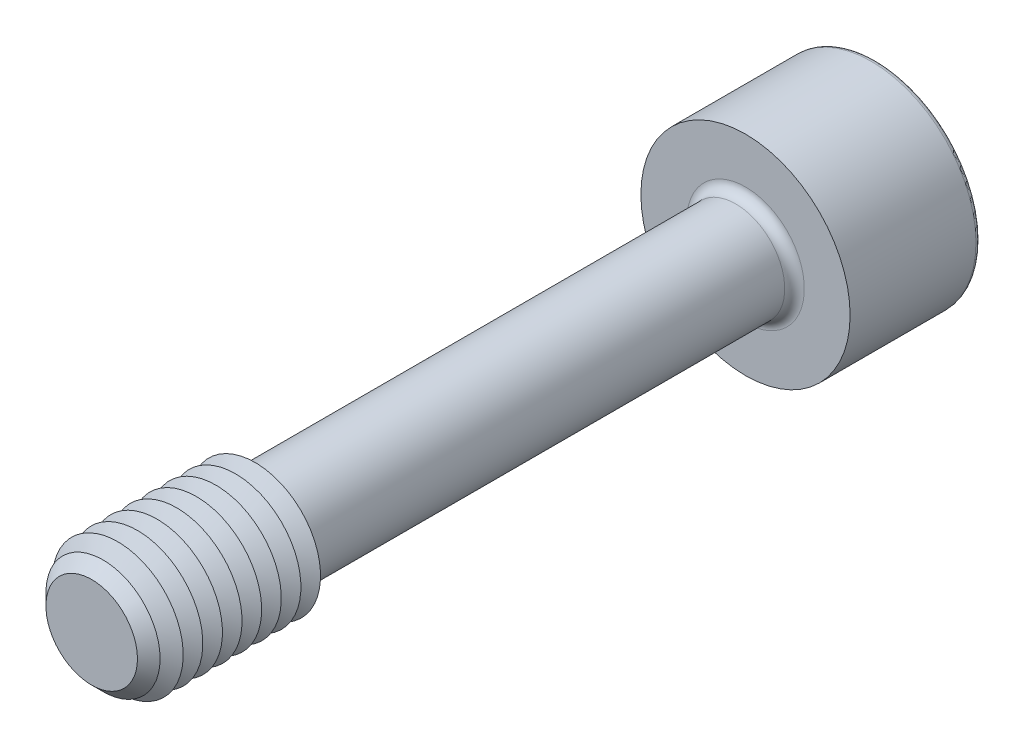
ISO-10303-21;
HEADER;
FILE_DESCRIPTION(('STEP AP214'),'2;1');
FILE_NAME('part.step','',(''),(''),'','','');
FILE_SCHEMA(('AUTOMOTIVE_DESIGN { 1 0 10303 214 1 1 1 1 }'));
ENDSEC;
DATA;
#1=APPLICATION_CONTEXT('core data for automotive mechanical design processes');
#2=APPLICATION_PROTOCOL_DEFINITION('international standard','automotive_design',2000,#1);
#3=PRODUCT_CONTEXT('',#1,'mechanical');
#4=PRODUCT('Part','Part','',(#3));
#5=PRODUCT_RELATED_PRODUCT_CATEGORY('part','',(#4));
#6=PRODUCT_DEFINITION_FORMATION('','',#4);
#7=PRODUCT_DEFINITION_CONTEXT('part definition',#1,'design');
#8=PRODUCT_DEFINITION('design','',#6,#7);
#9=PRODUCT_DEFINITION_SHAPE('','',#8);
#10=(LENGTH_UNIT() NAMED_UNIT(*) SI_UNIT(.MILLI.,.METRE.));
#11=(NAMED_UNIT(*) PLANE_ANGLE_UNIT() SI_UNIT($,.RADIAN.));
#12=(NAMED_UNIT(*) SI_UNIT($,.STERADIAN.) SOLID_ANGLE_UNIT());
#13=UNCERTAINTY_MEASURE_WITH_UNIT(LENGTH_MEASURE(1.E-05),#10,'distance_accuracy_value','');
#14=(GEOMETRIC_REPRESENTATION_CONTEXT(3) GLOBAL_UNCERTAINTY_ASSIGNED_CONTEXT((#13)) GLOBAL_UNIT_ASSIGNED_CONTEXT((#10,
#11,#12)) REPRESENTATION_CONTEXT('',''));
#15=CARTESIAN_POINT('',(0.,0.,0.));
#16=DIRECTION('',(0.,0.,1.));
#17=DIRECTION('',(1.,0.,0.));
#18=AXIS2_PLACEMENT_3D('',#15,#16,#17);
#19=CARTESIAN_POINT('',(-2.3094010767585,-4.,-27.));
#20=DIRECTION('',(0.,0.,1.));
#21=DIRECTION('',(1.,0.,0.));
#22=AXIS2_PLACEMENT_3D('',#19,#20,#21);
#23=PLANE('',#22);
#24=DIRECTION('',(1.,0.,0.));
#25=VECTOR('',#24,1.);
#26=CARTESIAN_POINT('',(-2.3094010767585,-4.,-27.));
#27=LINE('',#26,#25);
#28=CARTESIAN_POINT('',(0.,-4.,-27.));
#29=VERTEX_POINT('',#28);
#30=CARTESIAN_POINT('',(2.3094010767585,-4.,-27.));
#31=VERTEX_POINT('',#30);
#32=EDGE_CURVE('E762',#29,#31,#27,.T.);
#33=ORIENTED_EDGE('',*,*,#32,.F.);
#34=CARTESIAN_POINT('',(0.,0.,-27.));
#35=DIRECTION('',(0.,0.,1.));
#36=DIRECTION('',(0.,-1.,0.));
#37=AXIS2_PLACEMENT_3D('',#34,#35,#36);
#38=CIRCLE('',#37,4.);
#39=CARTESIAN_POINT('',(3.46410161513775,-2.,-27.));
#40=VERTEX_POINT('',#39);
#41=EDGE_CURVE('E53',#29,#40,#38,.T.);
#42=ORIENTED_EDGE('',*,*,#41,.T.);
#43=DIRECTION('',(0.5,0.866025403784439,0.));
#44=VECTOR('',#43,1.);
#45=CARTESIAN_POINT('',(2.3094010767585,-4.,-27.));
#46=LINE('',#45,#44);
#47=EDGE_CURVE('E748',#31,#40,#46,.T.);
#48=ORIENTED_EDGE('',*,*,#47,.F.);
#49=EDGE_LOOP('',(#33,#42,#48));
#50=FACE_BOUND('',#49,.T.);
#51=ADVANCED_FACE('F41',(#50),#23,.F.);
#52=CARTESIAN_POINT('',(4.618802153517,0.,-27.));
#53=VERTEX_POINT('',#52);
#54=EDGE_CURVE('E758',#40,#53,#46,.T.);
#55=ORIENTED_EDGE('',*,*,#54,.F.);
#56=CARTESIAN_POINT('',(3.46410161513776,2.,-27.));
#57=VERTEX_POINT('',#56);
#58=EDGE_CURVE('E11',#40,#57,#38,.T.);
#59=ORIENTED_EDGE('',*,*,#58,.T.);
#60=DIRECTION('',(-0.5,0.866025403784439,0.));
#61=VECTOR('',#60,1.);
#62=CARTESIAN_POINT('',(4.618802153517,0.,-27.));
#63=LINE('',#62,#61);
#64=EDGE_CURVE('E747',#53,#57,#63,.T.);
#65=ORIENTED_EDGE('',*,*,#64,.F.);
#66=EDGE_LOOP('',(#55,#59,#65));
#67=FACE_BOUND('',#66,.T.);
#68=ADVANCED_FACE('F133',(#67),#23,.F.);
#69=CARTESIAN_POINT('',(2.3094010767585,4.,-27.));
#70=VERTEX_POINT('',#69);
#71=EDGE_CURVE('E743',#57,#70,#63,.T.);
#72=ORIENTED_EDGE('',*,*,#71,.F.);
#73=CARTESIAN_POINT('',(0.,4.,-27.));
#74=VERTEX_POINT('',#73);
#75=EDGE_CURVE('E51',#57,#74,#38,.T.);
#76=ORIENTED_EDGE('',*,*,#75,.T.);
#77=DIRECTION('',(-1.,0.,0.));
#78=VECTOR('',#77,1.);
#79=CARTESIAN_POINT('',(2.3094010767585,4.,-27.));
#80=LINE('',#79,#78);
#81=EDGE_CURVE('E177',#70,#74,#80,.T.);
#82=ORIENTED_EDGE('',*,*,#81,.F.);
#83=EDGE_LOOP('',(#72,#76,#82));
#84=FACE_BOUND('',#83,.T.);
#85=ADVANCED_FACE('F139',(#84),#23,.F.);
#86=CARTESIAN_POINT('',(-2.3094010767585,4.,-27.));
#87=VERTEX_POINT('',#86);
#88=EDGE_CURVE('E753',#74,#87,#80,.T.);
#89=ORIENTED_EDGE('',*,*,#88,.F.);
#90=CARTESIAN_POINT('',(-3.46410161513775,2.,-27.));
#91=VERTEX_POINT('',#90);
#92=EDGE_CURVE('E262',#74,#91,#38,.T.);
#93=ORIENTED_EDGE('',*,*,#92,.T.);
#94=DIRECTION('',(-0.500000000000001,-0.866025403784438,0.));
#95=VECTOR('',#94,1.);
#96=CARTESIAN_POINT('',(-2.3094010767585,4.,-27.));
#97=LINE('',#96,#95);
#98=EDGE_CURVE('E176',#87,#91,#97,.T.);
#99=ORIENTED_EDGE('',*,*,#98,.F.);
#100=EDGE_LOOP('',(#89,#93,#99));
#101=FACE_BOUND('',#100,.T.);
#102=ADVANCED_FACE('F157',(#101),#23,.F.);
#103=CARTESIAN_POINT('',(-4.61880215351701,0.,-27.));
#104=VERTEX_POINT('',#103);
#105=EDGE_CURVE('E170',#91,#104,#97,.T.);
#106=ORIENTED_EDGE('',*,*,#105,.F.);
#107=CARTESIAN_POINT('',(-3.46410161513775,-2.,-27.));
#108=VERTEX_POINT('',#107);
#109=EDGE_CURVE('E172',#91,#108,#38,.T.);
#110=ORIENTED_EDGE('',*,*,#109,.T.);
#111=DIRECTION('',(0.5,-0.866025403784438,0.));
#112=VECTOR('',#111,1.);
#113=CARTESIAN_POINT('',(-4.61880215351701,0.,-27.));
#114=LINE('',#113,#112);
#115=EDGE_CURVE('E174',#104,#108,#114,.T.);
#116=ORIENTED_EDGE('',*,*,#115,.F.);
#117=EDGE_LOOP('',(#106,#110,#116));
#118=FACE_BOUND('',#117,.T.);
#119=ADVANCED_FACE('F146',(#118),#23,.F.);
#120=CARTESIAN_POINT('',(0.,0.,-35.));
#121=DIRECTION('',(0.,0.,-1.));
#122=DIRECTION('',(-1.,0.,0.));
#123=AXIS2_PLACEMENT_3D('',#120,#121,#122);
#124=PLANE('',#123);
#125=CARTESIAN_POINT('',(0.,0.,-35.));
#126=DIRECTION('',(0.,0.,-1.));
#127=DIRECTION('',(-1.,0.,0.));
#128=AXIS2_PLACEMENT_3D('',#125,#126,#127);
#129=CIRCLE('',#128,7.625);
#130=CARTESIAN_POINT('',(-7.625,0.,-35.));
#131=VERTEX_POINT('',#130);
#132=EDGE_CURVE('E250',#131,#131,#129,.T.);
#133=ORIENTED_EDGE('',*,*,#132,.T.);
#134=EDGE_LOOP('',(#133));
#135=FACE_BOUND('',#134,.T.);
#136=DIRECTION('',(-0.500000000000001,-0.866025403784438,0.));
#137=VECTOR('',#136,1.);
#138=CARTESIAN_POINT('',(-2.3094010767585,4.,-35.));
#139=LINE('',#138,#137);
#140=CARTESIAN_POINT('',(-2.3094010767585,4.,-35.));
#141=VERTEX_POINT('',#140);
#142=CARTESIAN_POINT('',(-4.61880215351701,0.,-35.));
#143=VERTEX_POINT('',#142);
#144=EDGE_CURVE('E212',#141,#143,#139,.T.);
#145=ORIENTED_EDGE('',*,*,#144,.T.);
#146=DIRECTION('',(0.5,-0.866025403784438,0.));
#147=VECTOR('',#146,1.);
#148=CARTESIAN_POINT('',(-4.61880215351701,0.,-35.));
#149=LINE('',#148,#147);
#150=CARTESIAN_POINT('',(-2.3094010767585,-4.,-35.));
#151=VERTEX_POINT('',#150);
#152=EDGE_CURVE('E67',#143,#151,#149,.T.);
#153=ORIENTED_EDGE('',*,*,#152,.T.);
#154=DIRECTION('',(1.,0.,0.));
#155=VECTOR('',#154,1.);
#156=CARTESIAN_POINT('',(-2.3094010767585,-4.,-35.));
#157=LINE('',#156,#155);
#158=CARTESIAN_POINT('',(2.3094010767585,-4.,-35.));
#159=VERTEX_POINT('',#158);
#160=EDGE_CURVE('E196',#151,#159,#157,.T.);
#161=ORIENTED_EDGE('',*,*,#160,.T.);
#162=DIRECTION('',(0.5,0.866025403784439,0.));
#163=VECTOR('',#162,1.);
#164=CARTESIAN_POINT('',(2.3094010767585,-4.,-35.));
#165=LINE('',#164,#163);
#166=CARTESIAN_POINT('',(4.618802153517,0.,-35.));
#167=VERTEX_POINT('',#166);
#168=EDGE_CURVE('E200',#159,#167,#165,.T.);
#169=ORIENTED_EDGE('',*,*,#168,.T.);
#170=DIRECTION('',(-0.5,0.866025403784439,0.));
#171=VECTOR('',#170,1.);
#172=CARTESIAN_POINT('',(4.618802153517,0.,-35.));
#173=LINE('',#172,#171);
#174=CARTESIAN_POINT('',(2.3094010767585,4.,-35.));
#175=VERTEX_POINT('',#174);
#176=EDGE_CURVE('E204',#167,#175,#173,.T.);
#177=ORIENTED_EDGE('',*,*,#176,.T.);
#178=DIRECTION('',(-1.,0.,0.));
#179=VECTOR('',#178,1.);
#180=CARTESIAN_POINT('',(2.3094010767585,4.,-35.));
#181=LINE('',#180,#179);
#182=EDGE_CURVE('E208',#175,#141,#181,.T.);
#183=ORIENTED_EDGE('',*,*,#182,.T.);
#184=EDGE_LOOP('',(#145,#153,#161,#169,#177,#183));
#185=FACE_BOUND('',#184,.T.);
#186=ADVANCED_FACE('F156',(#135,#185),#124,.T.);
#187=CARTESIAN_POINT('',(0.,0.,25.));
#188=DIRECTION('',(0.,0.,-1.));
#189=DIRECTION('',(-1.,0.,0.));
#190=AXIS2_PLACEMENT_3D('',#187,#188,#189);
#191=CYLINDRICAL_SURFACE('',#190,3.75);
#192=CARTESIAN_POINT('',(0.,0.,-24.25));
#193=DIRECTION('',(0.,0.,-1.));
#194=DIRECTION('',(-1.,0.,0.));
#195=AXIS2_PLACEMENT_3D('',#192,#193,#194);
#196=CIRCLE('',#195,3.75);
#197=CARTESIAN_POINT('',(-3.75,0.,-24.25));
#198=VERTEX_POINT('',#197);
#199=EDGE_CURVE('E247',#198,#198,#196,.F.);
#200=ORIENTED_EDGE('',*,*,#199,.T.);
#201=EDGE_LOOP('',(#200));
#202=FACE_BOUND('',#201,.T.);
#203=CARTESIAN_POINT('',(0.,0.,11.778312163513));
#204=DIRECTION('',(0.,0.,-1.));
#205=DIRECTION('',(0.,1.,0.));
#206=AXIS2_PLACEMENT_3D('',#203,#204,#205);
#207=CIRCLE('',#206,3.75);
#208=CARTESIAN_POINT('',(0.,3.75,11.778312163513));
#209=VERTEX_POINT('',#208);
#210=EDGE_CURVE('E235',#209,#209,#207,.T.);
#211=ORIENTED_EDGE('',*,*,#210,.T.);
#212=EDGE_LOOP('',(#211));
#213=FACE_BOUND('',#212,.T.);
#214=ADVANCED_FACE('F163',(#202,#213),#191,.T.);
#215=CARTESIAN_POINT('',(0.,0.,11.778312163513));
#216=DIRECTION('',(0.,0.,1.));
#217=DIRECTION('',(0.,-1.,0.));
#218=AXIS2_PLACEMENT_3D('',#215,#216,#217);
#219=CONICAL_SURFACE('',#218,3.75,1.0471975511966);
#220=CARTESIAN_POINT('',(0.,0.,12.5));
#221=DIRECTION('',(0.,0.,-1.));
#222=DIRECTION('',(-1.,0.,0.));
#223=AXIS2_PLACEMENT_3D('',#220,#221,#222);
#224=CIRCLE('',#223,5.);
#225=CARTESIAN_POINT('',(-5.,0.,12.5));
#226=VERTEX_POINT('',#225);
#227=EDGE_CURVE('E266',#226,#226,#224,.T.);
#228=ORIENTED_EDGE('',*,*,#227,.T.);
#229=EDGE_LOOP('',(#228));
#230=FACE_BOUND('',#229,.T.);
#231=ORIENTED_EDGE('',*,*,#210,.F.);
#232=EDGE_LOOP('',(#231));
#233=FACE_BOUND('',#232,.T.);
#234=ADVANCED_FACE('F512',(#230,#233),#219,.T.);
#235=CARTESIAN_POINT('',(0.,0.,-25.));
#236=DIRECTION('',(0.,0.,-1.));
#237=DIRECTION('',(-1.,0.,0.));
#238=AXIS2_PLACEMENT_3D('',#235,#236,#237);
#239=PLANE('',#238);
#240=CARTESIAN_POINT('',(0.,0.,-25.));
#241=DIRECTION('',(0.,0.,-1.));
#242=DIRECTION('',(-1.,0.,0.));
#243=AXIS2_PLACEMENT_3D('',#240,#241,#242);
#244=CIRCLE('',#243,4.5);
#245=CARTESIAN_POINT('',(-4.5,0.,-25.));
#246=VERTEX_POINT('',#245);
#247=EDGE_CURVE('E243',#246,#246,#244,.T.);
#248=ORIENTED_EDGE('',*,*,#247,.T.);
#249=EDGE_LOOP('',(#248));
#250=FACE_BOUND('',#249,.T.);
#251=CARTESIAN_POINT('',(0.,0.,-25.));
#252=DIRECTION('',(0.,0.,-1.));
#253=DIRECTION('',(-1.,0.,0.));
#254=AXIS2_PLACEMENT_3D('',#251,#252,#253);
#255=CIRCLE('',#254,8.);
#256=CARTESIAN_POINT('',(-8.,0.,-25.));
#257=VERTEX_POINT('',#256);
#258=EDGE_CURVE('E231',#257,#257,#255,.T.);
#259=ORIENTED_EDGE('',*,*,#258,.F.);
#260=EDGE_LOOP('',(#259));
#261=FACE_BOUND('',#260,.T.);
#262=ADVANCED_FACE('F505',(#250,#261),#239,.F.);
#263=CARTESIAN_POINT('',(0.,0.,-35.));
#264=DIRECTION('',(0.,0.,1.));
#265=DIRECTION('',(1.,0.,0.));
#266=AXIS2_PLACEMENT_3D('',#263,#264,#265);
#267=CYLINDRICAL_SURFACE('',#266,8.);
#268=CARTESIAN_POINT('',(0.,0.,-34.625));
#269=DIRECTION('',(0.,0.,-1.));
#270=DIRECTION('',(-1.,0.,0.));
#271=AXIS2_PLACEMENT_3D('',#268,#269,#270);
#272=CIRCLE('',#271,8.);
#273=CARTESIAN_POINT('',(-8.,0.,-34.625));
#274=VERTEX_POINT('',#273);
#275=EDGE_CURVE('E253',#274,#274,#272,.F.);
#276=ORIENTED_EDGE('',*,*,#275,.T.);
#277=EDGE_LOOP('',(#276));
#278=FACE_BOUND('',#277,.T.);
#279=ORIENTED_EDGE('',*,*,#258,.T.);
#280=EDGE_LOOP('',(#279));
#281=FACE_BOUND('',#280,.T.);
#282=ADVANCED_FACE('F511',(#278,#281),#267,.T.);
#283=CARTESIAN_POINT('',(-4.61880215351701,0.,-27.));
#284=DIRECTION('',(0.866025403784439,0.5,0.));
#285=DIRECTION('',(-0.5,0.866025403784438,0.));
#286=AXIS2_PLACEMENT_3D('',#283,#284,#285);
#287=PLANE('',#286);
#288=ORIENTED_EDGE('',*,*,#152,.F.);
#289=DIRECTION('',(0.,0.,-1.));
#290=VECTOR('',#289,1.);
#291=CARTESIAN_POINT('',(-4.61880215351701,0.,-27.));
#292=LINE('',#291,#290);
#293=EDGE_CURVE('E186',#104,#143,#292,.T.);
#294=ORIENTED_EDGE('',*,*,#293,.F.);
#295=ORIENTED_EDGE('',*,*,#115,.T.);
#296=CARTESIAN_POINT('',(-2.3094010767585,-4.,-27.));
#297=VERTEX_POINT('',#296);
#298=EDGE_CURVE('E215',#108,#297,#114,.T.);
#299=ORIENTED_EDGE('',*,*,#298,.T.);
#300=DIRECTION('',(0.,0.,-1.));
#301=VECTOR('',#300,1.);
#302=CARTESIAN_POINT('',(-2.3094010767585,-4.,-27.));
#303=LINE('',#302,#301);
#304=EDGE_CURVE('E228',#297,#151,#303,.T.);
#305=ORIENTED_EDGE('',*,*,#304,.T.);
#306=EDGE_LOOP('',(#288,#294,#295,#299,#305));
#307=FACE_BOUND('',#306,.T.);
#308=ADVANCED_FACE('F523',(#307),#287,.T.);
#309=CARTESIAN_POINT('',(-2.3094010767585,-4.,-27.));
#310=DIRECTION('',(0.,1.,0.));
#311=DIRECTION('',(-1.,0.,0.));
#312=AXIS2_PLACEMENT_3D('',#309,#310,#311);
#313=PLANE('',#312);
#314=ORIENTED_EDGE('',*,*,#160,.F.);
#315=ORIENTED_EDGE('',*,*,#304,.F.);
#316=EDGE_CURVE('E759',#297,#29,#27,.T.);
#317=ORIENTED_EDGE('',*,*,#316,.T.);
#318=ORIENTED_EDGE('',*,*,#32,.T.);
#319=DIRECTION('',(0.,0.,-1.));
#320=VECTOR('',#319,1.);
#321=CARTESIAN_POINT('',(2.3094010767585,-4.,-27.));
#322=LINE('',#321,#320);
#323=EDGE_CURVE('E225',#31,#159,#322,.T.);
#324=ORIENTED_EDGE('',*,*,#323,.T.);
#325=EDGE_LOOP('',(#314,#315,#317,#318,#324));
#326=FACE_BOUND('',#325,.T.);
#327=ADVANCED_FACE('F539',(#326),#313,.T.);
#328=CARTESIAN_POINT('',(2.3094010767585,-4.,-27.));
#329=DIRECTION('',(-0.866025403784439,0.5,0.));
#330=DIRECTION('',(-0.5,-0.866025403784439,0.));
#331=AXIS2_PLACEMENT_3D('',#328,#329,#330);
#332=PLANE('',#331);
#333=ORIENTED_EDGE('',*,*,#168,.F.);
#334=ORIENTED_EDGE('',*,*,#323,.F.);
#335=ORIENTED_EDGE('',*,*,#47,.T.);
#336=ORIENTED_EDGE('',*,*,#54,.T.);
#337=DIRECTION('',(0.,0.,-1.));
#338=VECTOR('',#337,1.);
#339=CARTESIAN_POINT('',(4.618802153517,0.,-27.));
#340=LINE('',#339,#338);
#341=EDGE_CURVE('E222',#53,#167,#340,.T.);
#342=ORIENTED_EDGE('',*,*,#341,.T.);
#343=EDGE_LOOP('',(#333,#334,#335,#336,#342));
#344=FACE_BOUND('',#343,.T.);
#345=ADVANCED_FACE('F549',(#344),#332,.T.);
#346=CARTESIAN_POINT('',(4.618802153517,0.,-27.));
#347=DIRECTION('',(-0.866025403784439,-0.5,0.));
#348=DIRECTION('',(0.5,-0.866025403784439,0.));
#349=AXIS2_PLACEMENT_3D('',#346,#347,#348);
#350=PLANE('',#349);
#351=ORIENTED_EDGE('',*,*,#176,.F.);
#352=ORIENTED_EDGE('',*,*,#341,.F.);
#353=ORIENTED_EDGE('',*,*,#64,.T.);
#354=ORIENTED_EDGE('',*,*,#71,.T.);
#355=DIRECTION('',(0.,0.,-1.));
#356=VECTOR('',#355,1.);
#357=CARTESIAN_POINT('',(2.3094010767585,4.,-27.));
#358=LINE('',#357,#356);
#359=EDGE_CURVE('E219',#70,#175,#358,.T.);
#360=ORIENTED_EDGE('',*,*,#359,.T.);
#361=EDGE_LOOP('',(#351,#352,#353,#354,#360));
#362=FACE_BOUND('',#361,.T.);
#363=ADVANCED_FACE('F559',(#362),#350,.T.);
#364=CARTESIAN_POINT('',(2.3094010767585,4.,-27.));
#365=DIRECTION('',(0.,-1.,0.));
#366=DIRECTION('',(0.,0.,-1.));
#367=AXIS2_PLACEMENT_3D('',#364,#365,#366);
#368=PLANE('',#367);
#369=ORIENTED_EDGE('',*,*,#182,.F.);
#370=ORIENTED_EDGE('',*,*,#359,.F.);
#371=ORIENTED_EDGE('',*,*,#81,.T.);
#372=ORIENTED_EDGE('',*,*,#88,.T.);
#373=DIRECTION('',(0.,0.,-1.));
#374=VECTOR('',#373,1.);
#375=CARTESIAN_POINT('',(-2.3094010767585,4.,-27.));
#376=LINE('',#375,#374);
#377=EDGE_CURVE('E182',#87,#141,#376,.T.);
#378=ORIENTED_EDGE('',*,*,#377,.T.);
#379=EDGE_LOOP('',(#369,#370,#371,#372,#378));
#380=FACE_BOUND('',#379,.T.);
#381=ADVANCED_FACE('F152',(#380),#368,.T.);
#382=CARTESIAN_POINT('',(-2.3094010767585,4.,-27.));
#383=DIRECTION('',(0.866025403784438,-0.500000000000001,0.));
#384=DIRECTION('',(0.500000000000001,0.866025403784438,0.));
#385=AXIS2_PLACEMENT_3D('',#382,#383,#384);
#386=PLANE('',#385);
#387=ORIENTED_EDGE('',*,*,#144,.F.);
#388=ORIENTED_EDGE('',*,*,#377,.F.);
#389=ORIENTED_EDGE('',*,*,#98,.T.);
#390=ORIENTED_EDGE('',*,*,#105,.T.);
#391=ORIENTED_EDGE('',*,*,#293,.T.);
#392=EDGE_LOOP('',(#387,#388,#389,#390,#391));
#393=FACE_BOUND('',#392,.T.);
#394=ADVANCED_FACE('F144',(#393),#386,.T.);
#395=ORIENTED_EDGE('',*,*,#298,.F.);
#396=EDGE_CURVE('E256',#108,#29,#38,.T.);
#397=ORIENTED_EDGE('',*,*,#396,.T.);
#398=ORIENTED_EDGE('',*,*,#316,.F.);
#399=EDGE_LOOP('',(#395,#397,#398));
#400=FACE_BOUND('',#399,.T.);
#401=ADVANCED_FACE('F135',(#400),#23,.F.);
#402=CARTESIAN_POINT('',(0.,0.,-24.25));
#403=DIRECTION('',(0.,0.,-1.));
#404=DIRECTION('',(-1.,0.,0.));
#405=AXIS2_PLACEMENT_3D('',#402,#403,#404);
#406=TOROIDAL_SURFACE('',#405,4.5,0.75);
#407=ORIENTED_EDGE('',*,*,#199,.F.);
#408=EDGE_LOOP('',(#407));
#409=FACE_BOUND('',#408,.T.);
#410=ORIENTED_EDGE('',*,*,#247,.F.);
#411=EDGE_LOOP('',(#410));
#412=FACE_BOUND('',#411,.T.);
#413=ADVANCED_FACE('F129',(#409,#412),#406,.F.);
#414=CARTESIAN_POINT('',(0.,0.,-34.625));
#415=DIRECTION('',(0.,0.,-1.));
#416=DIRECTION('',(-1.,0.,0.));
#417=AXIS2_PLACEMENT_3D('',#414,#415,#416);
#418=TOROIDAL_SURFACE('',#417,7.625,0.375);
#419=ORIENTED_EDGE('',*,*,#275,.F.);
#420=EDGE_LOOP('',(#419));
#421=FACE_BOUND('',#420,.T.);
#422=ORIENTED_EDGE('',*,*,#132,.F.);
#423=EDGE_LOOP('',(#422));
#424=FACE_BOUND('',#423,.T.);
#425=ADVANCED_FACE('F43',(#421,#424),#418,.T.);
#426=CARTESIAN_POINT('',(0.,0.,-24.6905989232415));
#427=DIRECTION('',(0.,0.,-1.));
#428=DIRECTION('',(0.,1.,0.));
#429=AXIS2_PLACEMENT_3D('',#426,#427,#428);
#430=CONICAL_SURFACE('',#429,0.,1.0471975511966);
#431=ORIENTED_EDGE('',*,*,#41,.F.);
#432=ORIENTED_EDGE('',*,*,#396,.F.);
#433=ORIENTED_EDGE('',*,*,#109,.F.);
#434=ORIENTED_EDGE('',*,*,#92,.F.);
#435=ORIENTED_EDGE('',*,*,#75,.F.);
#436=ORIENTED_EDGE('',*,*,#58,.F.);
#437=EDGE_LOOP('',(#431,#432,#433,#434,#435,#436));
#438=FACE_BOUND('',#437,.T.);
#439=CARTESIAN_POINT('',(0.,0.,-24.6905989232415));
#440=VERTEX_POINT('',#439);
#441=VERTEX_LOOP('',#440);
#442=FACE_BOUND('',#441,.T.);
#443=ADVANCED_FACE('F118',(#438,#442),#430,.F.);
#444=CARTESIAN_POINT('',(0.,0.,13.25));
#445=DIRECTION('',(0.,0.,-1.));
#446=DIRECTION('',(-1.,0.,0.));
#447=AXIS2_PLACEMENT_3D('',#444,#445,#446);
#448=CONICAL_SURFACE('',#447,3.70096189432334,1.0471975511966);
#449=ORIENTED_EDGE('',*,*,#227,.F.);
#450=EDGE_LOOP('',(#449));
#451=FACE_BOUND('',#450,.T.);
#452=CARTESIAN_POINT('',(0.,0.,13.25));
#453=DIRECTION('',(0.,0.,-1.));
#454=DIRECTION('',(-1.,0.,0.));
#455=AXIS2_PLACEMENT_3D('',#452,#453,#454);
#456=CIRCLE('',#455,3.70096189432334);
#457=CARTESIAN_POINT('',(-3.70096189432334,0.,13.25));
#458=VERTEX_POINT('',#457);
#459=EDGE_CURVE('E272',#458,#458,#456,.T.);
#460=ORIENTED_EDGE('',*,*,#459,.T.);
#461=EDGE_LOOP('',(#460));
#462=FACE_BOUND('',#461,.T.);
#463=ADVANCED_FACE('F120',(#451,#462),#448,.T.);
#464=CARTESIAN_POINT('',(0.,0.,14.));
#465=DIRECTION('',(0.,0.,1.));
#466=DIRECTION('',(1.,0.,0.));
#467=AXIS2_PLACEMENT_3D('',#464,#465,#466);
#468=CONICAL_SURFACE('',#467,5.,1.0471975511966);
#469=ORIENTED_EDGE('',*,*,#459,.F.);
#470=EDGE_LOOP('',(#469));
#471=FACE_BOUND('',#470,.T.);
#472=CARTESIAN_POINT('',(0.,0.,14.));
#473=DIRECTION('',(0.,0.,-1.));
#474=DIRECTION('',(-1.,0.,0.));
#475=AXIS2_PLACEMENT_3D('',#472,#473,#474);
#476=CIRCLE('',#475,5.);
#477=CARTESIAN_POINT('',(-5.,0.,14.));
#478=VERTEX_POINT('',#477);
#479=EDGE_CURVE('E279',#478,#478,#476,.T.);
#480=ORIENTED_EDGE('',*,*,#479,.T.);
#481=EDGE_LOOP('',(#480));
#482=FACE_BOUND('',#481,.T.);
#483=ADVANCED_FACE('F126',(#471,#482),#468,.T.);
#484=CARTESIAN_POINT('',(0.,0.,14.75));
#485=DIRECTION('',(0.,0.,-1.));
#486=DIRECTION('',(-1.,0.,0.));
#487=AXIS2_PLACEMENT_3D('',#484,#485,#486);
#488=CONICAL_SURFACE('',#487,3.70096189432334,1.0471975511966);
#489=ORIENTED_EDGE('',*,*,#479,.F.);
#490=EDGE_LOOP('',(#489));
#491=FACE_BOUND('',#490,.T.);
#492=CARTESIAN_POINT('',(0.,0.,14.75));
#493=DIRECTION('',(0.,0.,-1.));
#494=DIRECTION('',(-1.,0.,0.));
#495=AXIS2_PLACEMENT_3D('',#492,#493,#494);
#496=CIRCLE('',#495,3.70096189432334);
#497=CARTESIAN_POINT('',(-3.70096189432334,0.,14.75));
#498=VERTEX_POINT('',#497);
#499=EDGE_CURVE('E285',#498,#498,#496,.T.);
#500=ORIENTED_EDGE('',*,*,#499,.T.);
#501=EDGE_LOOP('',(#500));
#502=FACE_BOUND('',#501,.T.);
#503=ADVANCED_FACE('F399',(#491,#502),#488,.T.);
#504=CARTESIAN_POINT('',(0.,0.,15.5));
#505=DIRECTION('',(0.,0.,1.));
#506=DIRECTION('',(1.,0.,0.));
#507=AXIS2_PLACEMENT_3D('',#504,#505,#506);
#508=CONICAL_SURFACE('',#507,5.,1.0471975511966);
#509=ORIENTED_EDGE('',*,*,#499,.F.);
#510=EDGE_LOOP('',(#509));
#511=FACE_BOUND('',#510,.T.);
#512=CARTESIAN_POINT('',(0.,0.,15.5));
#513=DIRECTION('',(0.,0.,-1.));
#514=DIRECTION('',(-1.,0.,0.));
#515=AXIS2_PLACEMENT_3D('',#512,#513,#514);
#516=CIRCLE('',#515,5.);
#517=CARTESIAN_POINT('',(-5.,0.,15.5));
#518=VERTEX_POINT('',#517);
#519=EDGE_CURVE('E289',#518,#518,#516,.T.);
#520=ORIENTED_EDGE('',*,*,#519,.T.);
#521=EDGE_LOOP('',(#520));
#522=FACE_BOUND('',#521,.T.);
#523=ADVANCED_FACE('F395',(#511,#522),#508,.T.);
#524=CARTESIAN_POINT('',(0.,0.,16.25));
#525=DIRECTION('',(0.,0.,-1.));
#526=DIRECTION('',(-1.,0.,0.));
#527=AXIS2_PLACEMENT_3D('',#524,#525,#526);
#528=CONICAL_SURFACE('',#527,3.70096189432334,1.0471975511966);
#529=ORIENTED_EDGE('',*,*,#519,.F.);
#530=EDGE_LOOP('',(#529));
#531=FACE_BOUND('',#530,.T.);
#532=CARTESIAN_POINT('',(0.,0.,16.25));
#533=DIRECTION('',(0.,0.,-1.));
#534=DIRECTION('',(-1.,0.,0.));
#535=AXIS2_PLACEMENT_3D('',#532,#533,#534);
#536=CIRCLE('',#535,3.70096189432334);
#537=CARTESIAN_POINT('',(-3.70096189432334,0.,16.25));
#538=VERTEX_POINT('',#537);
#539=EDGE_CURVE('E293',#538,#538,#536,.T.);
#540=ORIENTED_EDGE('',*,*,#539,.T.);
#541=EDGE_LOOP('',(#540));
#542=FACE_BOUND('',#541,.T.);
#543=ADVANCED_FACE('F391',(#531,#542),#528,.T.);
#544=CARTESIAN_POINT('',(0.,0.,17.));
#545=DIRECTION('',(0.,0.,1.));
#546=DIRECTION('',(1.,0.,0.));
#547=AXIS2_PLACEMENT_3D('',#544,#545,#546);
#548=CONICAL_SURFACE('',#547,5.,1.0471975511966);
#549=ORIENTED_EDGE('',*,*,#539,.F.);
#550=EDGE_LOOP('',(#549));
#551=FACE_BOUND('',#550,.T.);
#552=CARTESIAN_POINT('',(0.,0.,17.));
#553=DIRECTION('',(0.,0.,-1.));
#554=DIRECTION('',(-1.,0.,0.));
#555=AXIS2_PLACEMENT_3D('',#552,#553,#554);
#556=CIRCLE('',#555,5.);
#557=CARTESIAN_POINT('',(-5.,0.,17.));
#558=VERTEX_POINT('',#557);
#559=EDGE_CURVE('E297',#558,#558,#556,.T.);
#560=ORIENTED_EDGE('',*,*,#559,.T.);
#561=EDGE_LOOP('',(#560));
#562=FACE_BOUND('',#561,.T.);
#563=ADVANCED_FACE('F387',(#551,#562),#548,.T.);
#564=CARTESIAN_POINT('',(0.,0.,17.75));
#565=DIRECTION('',(0.,0.,-1.));
#566=DIRECTION('',(-1.,0.,0.));
#567=AXIS2_PLACEMENT_3D('',#564,#565,#566);
#568=CONICAL_SURFACE('',#567,3.70096189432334,1.0471975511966);
#569=ORIENTED_EDGE('',*,*,#559,.F.);
#570=EDGE_LOOP('',(#569));
#571=FACE_BOUND('',#570,.T.);
#572=CARTESIAN_POINT('',(0.,0.,17.75));
#573=DIRECTION('',(0.,0.,-1.));
#574=DIRECTION('',(-1.,0.,0.));
#575=AXIS2_PLACEMENT_3D('',#572,#573,#574);
#576=CIRCLE('',#575,3.70096189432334);
#577=CARTESIAN_POINT('',(-3.70096189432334,0.,17.75));
#578=VERTEX_POINT('',#577);
#579=EDGE_CURVE('E301',#578,#578,#576,.T.);
#580=ORIENTED_EDGE('',*,*,#579,.T.);
#581=EDGE_LOOP('',(#580));
#582=FACE_BOUND('',#581,.T.);
#583=ADVANCED_FACE('F383',(#571,#582),#568,.T.);
#584=CARTESIAN_POINT('',(0.,0.,18.5));
#585=DIRECTION('',(0.,0.,1.));
#586=DIRECTION('',(1.,0.,0.));
#587=AXIS2_PLACEMENT_3D('',#584,#585,#586);
#588=CONICAL_SURFACE('',#587,5.,1.0471975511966);
#589=ORIENTED_EDGE('',*,*,#579,.F.);
#590=EDGE_LOOP('',(#589));
#591=FACE_BOUND('',#590,.T.);
#592=CARTESIAN_POINT('',(0.,0.,18.5));
#593=DIRECTION('',(0.,0.,-1.));
#594=DIRECTION('',(-1.,0.,0.));
#595=AXIS2_PLACEMENT_3D('',#592,#593,#594);
#596=CIRCLE('',#595,5.);
#597=CARTESIAN_POINT('',(-5.,0.,18.5));
#598=VERTEX_POINT('',#597);
#599=EDGE_CURVE('E305',#598,#598,#596,.T.);
#600=ORIENTED_EDGE('',*,*,#599,.T.);
#601=EDGE_LOOP('',(#600));
#602=FACE_BOUND('',#601,.T.);
#603=ADVANCED_FACE('F379',(#591,#602),#588,.T.);
#604=CARTESIAN_POINT('',(0.,0.,19.25));
#605=DIRECTION('',(0.,0.,-1.));
#606=DIRECTION('',(-1.,0.,0.));
#607=AXIS2_PLACEMENT_3D('',#604,#605,#606);
#608=CONICAL_SURFACE('',#607,3.70096189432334,1.0471975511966);
#609=ORIENTED_EDGE('',*,*,#599,.F.);
#610=EDGE_LOOP('',(#609));
#611=FACE_BOUND('',#610,.T.);
#612=CARTESIAN_POINT('',(0.,0.,19.25));
#613=DIRECTION('',(0.,0.,-1.));
#614=DIRECTION('',(-1.,0.,0.));
#615=AXIS2_PLACEMENT_3D('',#612,#613,#614);
#616=CIRCLE('',#615,3.70096189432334);
#617=CARTESIAN_POINT('',(-3.70096189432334,0.,19.25));
#618=VERTEX_POINT('',#617);
#619=EDGE_CURVE('E309',#618,#618,#616,.T.);
#620=ORIENTED_EDGE('',*,*,#619,.T.);
#621=EDGE_LOOP('',(#620));
#622=FACE_BOUND('',#621,.T.);
#623=ADVANCED_FACE('F375',(#611,#622),#608,.T.);
#624=CARTESIAN_POINT('',(0.,0.,20.));
#625=DIRECTION('',(0.,0.,1.));
#626=DIRECTION('',(1.,0.,0.));
#627=AXIS2_PLACEMENT_3D('',#624,#625,#626);
#628=CONICAL_SURFACE('',#627,5.,1.0471975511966);
#629=ORIENTED_EDGE('',*,*,#619,.F.);
#630=EDGE_LOOP('',(#629));
#631=FACE_BOUND('',#630,.T.);
#632=CARTESIAN_POINT('',(0.,0.,20.));
#633=DIRECTION('',(0.,0.,-1.));
#634=DIRECTION('',(-1.,0.,0.));
#635=AXIS2_PLACEMENT_3D('',#632,#633,#634);
#636=CIRCLE('',#635,5.);
#637=CARTESIAN_POINT('',(-5.,0.,20.));
#638=VERTEX_POINT('',#637);
#639=EDGE_CURVE('E313',#638,#638,#636,.T.);
#640=ORIENTED_EDGE('',*,*,#639,.T.);
#641=EDGE_LOOP('',(#640));
#642=FACE_BOUND('',#641,.T.);
#643=ADVANCED_FACE('F371',(#631,#642),#628,.T.);
#644=CARTESIAN_POINT('',(0.,0.,20.75));
#645=DIRECTION('',(0.,0.,-1.));
#646=DIRECTION('',(-1.,0.,0.));
#647=AXIS2_PLACEMENT_3D('',#644,#645,#646);
#648=CONICAL_SURFACE('',#647,3.70096189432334,1.0471975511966);
#649=ORIENTED_EDGE('',*,*,#639,.F.);
#650=EDGE_LOOP('',(#649));
#651=FACE_BOUND('',#650,.T.);
#652=CARTESIAN_POINT('',(0.,0.,20.75));
#653=DIRECTION('',(0.,0.,-1.));
#654=DIRECTION('',(-1.,0.,0.));
#655=AXIS2_PLACEMENT_3D('',#652,#653,#654);
#656=CIRCLE('',#655,3.70096189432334);
#657=CARTESIAN_POINT('',(-3.70096189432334,0.,20.75));
#658=VERTEX_POINT('',#657);
#659=EDGE_CURVE('E317',#658,#658,#656,.T.);
#660=ORIENTED_EDGE('',*,*,#659,.T.);
#661=EDGE_LOOP('',(#660));
#662=FACE_BOUND('',#661,.T.);
#663=ADVANCED_FACE('F367',(#651,#662),#648,.T.);
#664=CARTESIAN_POINT('',(0.,0.,21.5));
#665=DIRECTION('',(0.,0.,1.));
#666=DIRECTION('',(1.,0.,0.));
#667=AXIS2_PLACEMENT_3D('',#664,#665,#666);
#668=CONICAL_SURFACE('',#667,5.,1.0471975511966);
#669=ORIENTED_EDGE('',*,*,#659,.F.);
#670=EDGE_LOOP('',(#669));
#671=FACE_BOUND('',#670,.T.);
#672=CARTESIAN_POINT('',(0.,0.,21.5));
#673=DIRECTION('',(0.,0.,-1.));
#674=DIRECTION('',(-1.,0.,0.));
#675=AXIS2_PLACEMENT_3D('',#672,#673,#674);
#676=CIRCLE('',#675,5.);
#677=CARTESIAN_POINT('',(-5.,0.,21.5));
#678=VERTEX_POINT('',#677);
#679=EDGE_CURVE('E321',#678,#678,#676,.T.);
#680=ORIENTED_EDGE('',*,*,#679,.T.);
#681=EDGE_LOOP('',(#680));
#682=FACE_BOUND('',#681,.T.);
#683=ADVANCED_FACE('F363',(#671,#682),#668,.T.);
#684=CARTESIAN_POINT('',(0.,0.,22.25));
#685=DIRECTION('',(0.,0.,-1.));
#686=DIRECTION('',(-1.,0.,0.));
#687=AXIS2_PLACEMENT_3D('',#684,#685,#686);
#688=CONICAL_SURFACE('',#687,3.70096189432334,1.0471975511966);
#689=ORIENTED_EDGE('',*,*,#679,.F.);
#690=EDGE_LOOP('',(#689));
#691=FACE_BOUND('',#690,.T.);
#692=CARTESIAN_POINT('',(0.,0.,22.25));
#693=DIRECTION('',(0.,0.,-1.));
#694=DIRECTION('',(-1.,0.,0.));
#695=AXIS2_PLACEMENT_3D('',#692,#693,#694);
#696=CIRCLE('',#695,3.70096189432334);
#697=CARTESIAN_POINT('',(-3.70096189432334,0.,22.25));
#698=VERTEX_POINT('',#697);
#699=EDGE_CURVE('E325',#698,#698,#696,.T.);
#700=ORIENTED_EDGE('',*,*,#699,.T.);
#701=EDGE_LOOP('',(#700));
#702=FACE_BOUND('',#701,.T.);
#703=ADVANCED_FACE('F359',(#691,#702),#688,.T.);
#704=CARTESIAN_POINT('',(0.,0.,23.));
#705=DIRECTION('',(0.,0.,1.));
#706=DIRECTION('',(1.,0.,0.));
#707=AXIS2_PLACEMENT_3D('',#704,#705,#706);
#708=CONICAL_SURFACE('',#707,5.,1.0471975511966);
#709=ORIENTED_EDGE('',*,*,#699,.F.);
#710=EDGE_LOOP('',(#709));
#711=FACE_BOUND('',#710,.T.);
#712=CARTESIAN_POINT('',(0.,0.,23.));
#713=DIRECTION('',(0.,0.,-1.));
#714=DIRECTION('',(-1.,0.,0.));
#715=AXIS2_PLACEMENT_3D('',#712,#713,#714);
#716=CIRCLE('',#715,5.);
#717=CARTESIAN_POINT('',(-5.,0.,23.));
#718=VERTEX_POINT('',#717);
#719=EDGE_CURVE('E329',#718,#718,#716,.T.);
#720=ORIENTED_EDGE('',*,*,#719,.T.);
#721=EDGE_LOOP('',(#720));
#722=FACE_BOUND('',#721,.T.);
#723=ADVANCED_FACE('F352',(#711,#722),#708,.T.);
#724=CARTESIAN_POINT('',(0.,0.,23.75));
#725=DIRECTION('',(0.,0.,-1.));
#726=DIRECTION('',(-1.,0.,0.));
#727=AXIS2_PLACEMENT_3D('',#724,#725,#726);
#728=CONICAL_SURFACE('',#727,3.70096189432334,1.0471975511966);
#729=ORIENTED_EDGE('',*,*,#719,.F.);
#730=EDGE_LOOP('',(#729));
#731=FACE_BOUND('',#730,.T.);
#732=CARTESIAN_POINT('',(0.,0.,23.75));
#733=DIRECTION('',(0.,0.,-1.));
#734=DIRECTION('',(-1.,0.,0.));
#735=AXIS2_PLACEMENT_3D('',#732,#733,#734);
#736=CIRCLE('',#735,3.70096189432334);
#737=CARTESIAN_POINT('',(-3.70096189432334,0.,23.75));
#738=VERTEX_POINT('',#737);
#739=EDGE_CURVE('E333',#738,#738,#736,.T.);
#740=ORIENTED_EDGE('',*,*,#739,.T.);
#741=EDGE_LOOP('',(#740));
#742=FACE_BOUND('',#741,.T.);
#743=ADVANCED_FACE('F338',(#731,#742),#728,.T.);
#744=CARTESIAN_POINT('',(0.,0.,24.5));
#745=DIRECTION('',(0.,0.,1.));
#746=DIRECTION('',(1.,0.,0.));
#747=AXIS2_PLACEMENT_3D('',#744,#745,#746);
#748=CONICAL_SURFACE('',#747,5.,1.0471975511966);
#749=CARTESIAN_POINT('',(0.,0.,24.1339745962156));
#750=DIRECTION('',(0.,0.,1.));
#751=DIRECTION('',(1.,0.,0.));
#752=AXIS2_PLACEMENT_3D('',#749,#750,#751);
#753=CIRCLE('',#752,4.36602540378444);
#754=CARTESIAN_POINT('',(4.36602540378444,0.,24.1339745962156));
#755=VERTEX_POINT('',#754);
#756=EDGE_CURVE('E45',#755,#755,#753,.F.);
#757=ORIENTED_EDGE('',*,*,#756,.T.);
#758=EDGE_LOOP('',(#757));
#759=FACE_BOUND('',#758,.T.);
#760=ORIENTED_EDGE('',*,*,#739,.F.);
#761=EDGE_LOOP('',(#760));
#762=FACE_BOUND('',#761,.T.);
#763=ADVANCED_FACE('F340',(#759,#762),#748,.T.);
#764=CARTESIAN_POINT('',(0.,0.,25.));
#765=DIRECTION('',(0.,0.,1.));
#766=DIRECTION('',(1.,0.,0.));
#767=AXIS2_PLACEMENT_3D('',#764,#765,#766);
#768=PLANE('',#767);
#769=CARTESIAN_POINT('',(0.,0.,25.));
#770=DIRECTION('',(0.,0.,1.));
#771=DIRECTION('',(1.,0.,0.));
#772=AXIS2_PLACEMENT_3D('',#769,#770,#771);
#773=CIRCLE('',#772,3.49999999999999);
#774=CARTESIAN_POINT('',(3.49999999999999,0.,25.));
#775=VERTEX_POINT('',#774);
#776=EDGE_CURVE('E239',#775,#775,#773,.T.);
#777=ORIENTED_EDGE('',*,*,#776,.T.);
#778=EDGE_LOOP('',(#777));
#779=FACE_BOUND('',#778,.T.);
#780=ADVANCED_FACE('F342',(#779),#768,.T.);
#781=CARTESIAN_POINT('',(0.,0.,23.5));
#782=DIRECTION('',(0.,0.,-1.));
#783=DIRECTION('',(0.,1.,0.));
#784=AXIS2_PLACEMENT_3D('',#781,#782,#783);
#785=CONICAL_SURFACE('',#784,5.,0.785398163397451);
#786=ORIENTED_EDGE('',*,*,#756,.F.);
#787=EDGE_LOOP('',(#786));
#788=FACE_BOUND('',#787,.T.);
#789=ORIENTED_EDGE('',*,*,#776,.F.);
#790=EDGE_LOOP('',(#789));
#791=FACE_BOUND('',#790,.T.);
#792=ADVANCED_FACE('F349',(#788,#791),#785,.T.);
#793=CLOSED_SHELL('',(#51,#68,#85,#102,#119,#186,#214,#234,#262,#282,#308,#327,#345,#363,#381,
#394,#401,#413,#425,#443,#463,#483,#503,#523,#543,#563,#583,#603,#623,#643,#663,#683,#703,#723,
#743,#763,#780,#792));
#794=MANIFOLD_SOLID_BREP('B2',#793);
#795=ADVANCED_BREP_SHAPE_REPRESENTATION('',(#18,#794),#14);
#796=SHAPE_DEFINITION_REPRESENTATION(#9,#795);
ENDSEC;
END-ISO-10303-21;
